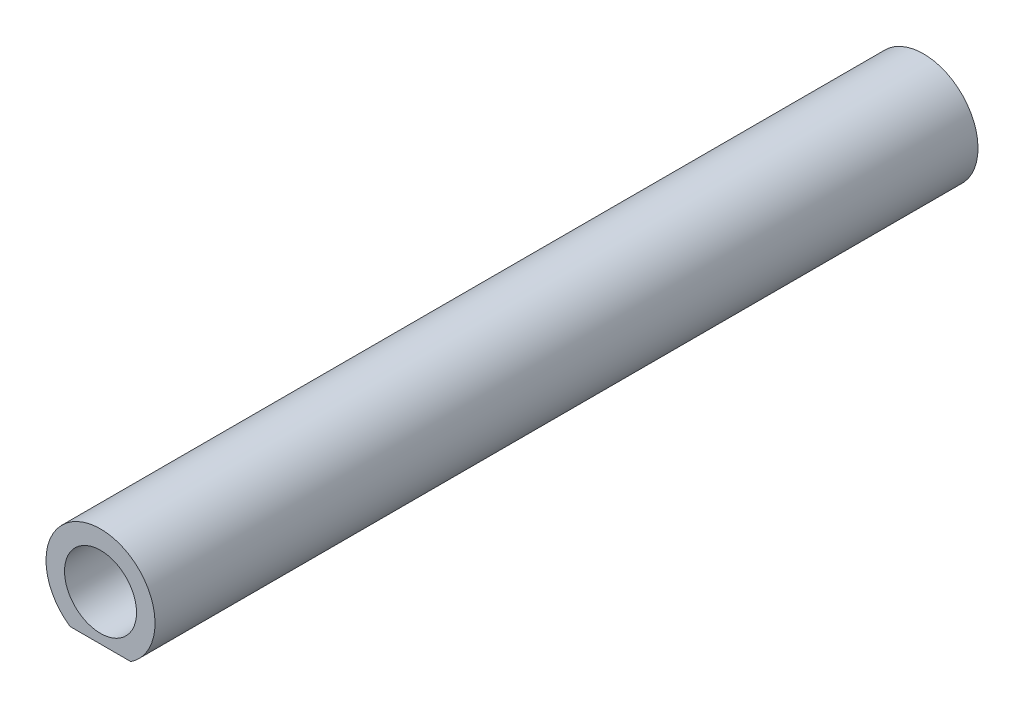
ISO-10303-21;
HEADER;
FILE_DESCRIPTION(('STEP AP214'),'2;1');
FILE_NAME('part.step','',(''),(''),'','','');
FILE_SCHEMA(('AUTOMOTIVE_DESIGN { 1 0 10303 214 1 1 1 1 }'));
ENDSEC;
DATA;
#1=APPLICATION_CONTEXT('core data for automotive mechanical design processes');
#2=APPLICATION_PROTOCOL_DEFINITION('international standard','automotive_design',2000,#1);
#3=PRODUCT_CONTEXT('',#1,'mechanical');
#4=PRODUCT('Part','Part','',(#3));
#5=PRODUCT_RELATED_PRODUCT_CATEGORY('part','',(#4));
#6=PRODUCT_DEFINITION_FORMATION('','',#4);
#7=PRODUCT_DEFINITION_CONTEXT('part definition',#1,'design');
#8=PRODUCT_DEFINITION('design','',#6,#7);
#9=PRODUCT_DEFINITION_SHAPE('','',#8);
#10=(LENGTH_UNIT() NAMED_UNIT(*) SI_UNIT(.MILLI.,.METRE.));
#11=(NAMED_UNIT(*) PLANE_ANGLE_UNIT() SI_UNIT($,.RADIAN.));
#12=(NAMED_UNIT(*) SI_UNIT($,.STERADIAN.) SOLID_ANGLE_UNIT());
#13=UNCERTAINTY_MEASURE_WITH_UNIT(LENGTH_MEASURE(1.E-05),#10,'distance_accuracy_value','');
#14=(GEOMETRIC_REPRESENTATION_CONTEXT(3) GLOBAL_UNCERTAINTY_ASSIGNED_CONTEXT((#13)) GLOBAL_UNIT_ASSIGNED_CONTEXT((#10,
#11,#12)) REPRESENTATION_CONTEXT('',''));
#15=CARTESIAN_POINT('',(0.,0.,0.));
#16=DIRECTION('',(0.,0.,1.));
#17=DIRECTION('',(1.,0.,0.));
#18=AXIS2_PLACEMENT_3D('',#15,#16,#17);
#19=CARTESIAN_POINT('',(0.,0.,254.));
#20=DIRECTION('',(0.,0.,-1.));
#21=DIRECTION('',(-1.,0.,0.));
#22=AXIS2_PLACEMENT_3D('',#19,#20,#21);
#23=CYLINDRICAL_SURFACE('',#22,16.8275);
#24=CARTESIAN_POINT('',(0.,0.,0.));
#25=DIRECTION('',(0.,0.,1.));
#26=DIRECTION('',(1.,0.,0.));
#27=AXIS2_PLACEMENT_3D('',#24,#25,#26);
#28=CIRCLE('',#27,16.8275);
#29=CARTESIAN_POINT('',(9.38103705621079,-13.97,0.));
#30=VERTEX_POINT('',#29);
#31=CARTESIAN_POINT('',(-9.38103705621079,-13.97,0.));
#32=VERTEX_POINT('',#31);
#33=EDGE_CURVE('E68',#30,#32,#28,.T.);
#34=ORIENTED_EDGE('',*,*,#33,.T.);
#35=DIRECTION('',(0.,0.,-1.));
#36=VECTOR('',#35,1.);
#37=CARTESIAN_POINT('',(-9.38103705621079,-13.97,254.));
#38=LINE('',#37,#36);
#39=CARTESIAN_POINT('',(-9.38103705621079,-13.97,254.));
#40=VERTEX_POINT('',#39);
#41=EDGE_CURVE('E11',#40,#32,#38,.T.);
#42=ORIENTED_EDGE('',*,*,#41,.F.);
#43=CARTESIAN_POINT('',(0.,0.,254.));
#44=DIRECTION('',(0.,0.,1.));
#45=DIRECTION('',(1.,0.,0.));
#46=AXIS2_PLACEMENT_3D('',#43,#44,#45);
#47=CIRCLE('',#46,16.8275);
#48=CARTESIAN_POINT('',(9.38103705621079,-13.97,254.));
#49=VERTEX_POINT('',#48);
#50=EDGE_CURVE('E71',#49,#40,#47,.T.);
#51=ORIENTED_EDGE('',*,*,#50,.F.);
#52=DIRECTION('',(0.,0.,-1.));
#53=VECTOR('',#52,1.);
#54=CARTESIAN_POINT('',(9.38103705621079,-13.97,254.));
#55=LINE('',#54,#53);
#56=EDGE_CURVE('E45',#49,#30,#55,.T.);
#57=ORIENTED_EDGE('',*,*,#56,.T.);
#58=EDGE_LOOP('',(#34,#42,#51,#57));
#59=FACE_BOUND('',#58,.T.);
#60=ADVANCED_FACE('F37',(#59),#23,.T.);
#61=CARTESIAN_POINT('',(0.,-13.97,254.));
#62=DIRECTION('',(0.,1.,0.));
#63=DIRECTION('',(0.,0.,1.));
#64=AXIS2_PLACEMENT_3D('',#61,#62,#63);
#65=PLANE('',#64);
#66=DIRECTION('',(1.,0.,0.));
#67=VECTOR('',#66,1.);
#68=CARTESIAN_POINT('',(0.,-13.97,0.));
#69=LINE('',#68,#67);
#70=EDGE_CURVE('E60',#32,#30,#69,.T.);
#71=ORIENTED_EDGE('',*,*,#70,.T.);
#72=ORIENTED_EDGE('',*,*,#56,.F.);
#73=DIRECTION('',(1.,0.,0.));
#74=VECTOR('',#73,1.);
#75=CARTESIAN_POINT('',(0.,-13.97,254.));
#76=LINE('',#75,#74);
#77=EDGE_CURVE('E52',#40,#49,#76,.T.);
#78=ORIENTED_EDGE('',*,*,#77,.F.);
#79=ORIENTED_EDGE('',*,*,#41,.T.);
#80=EDGE_LOOP('',(#71,#72,#78,#79));
#81=FACE_BOUND('',#80,.T.);
#82=ADVANCED_FACE('F63',(#81),#65,.F.);
#83=CARTESIAN_POINT('',(0.,0.,254.));
#84=DIRECTION('',(0.,0.,-1.));
#85=DIRECTION('',(-1.,0.,0.));
#86=AXIS2_PLACEMENT_3D('',#83,#84,#85);
#87=CYLINDRICAL_SURFACE('',#86,11.1125);
#88=CARTESIAN_POINT('',(0.,0.,254.));
#89=DIRECTION('',(0.,0.,1.));
#90=DIRECTION('',(1.,0.,0.));
#91=AXIS2_PLACEMENT_3D('',#88,#89,#90);
#92=CIRCLE('',#91,11.1125);
#93=CARTESIAN_POINT('',(11.1125,0.,254.));
#94=VERTEX_POINT('',#93);
#95=EDGE_CURVE('E72',#94,#94,#92,.T.);
#96=ORIENTED_EDGE('',*,*,#95,.T.);
#97=EDGE_LOOP('',(#96));
#98=FACE_BOUND('',#97,.T.);
#99=CARTESIAN_POINT('',(0.,0.,0.));
#100=DIRECTION('',(0.,0.,1.));
#101=DIRECTION('',(1.,0.,0.));
#102=AXIS2_PLACEMENT_3D('',#99,#100,#101);
#103=CIRCLE('',#102,11.1125);
#104=CARTESIAN_POINT('',(11.1125,0.,0.));
#105=VERTEX_POINT('',#104);
#106=EDGE_CURVE('E67',#105,#105,#103,.T.);
#107=ORIENTED_EDGE('',*,*,#106,.F.);
#108=EDGE_LOOP('',(#107));
#109=FACE_BOUND('',#108,.T.);
#110=ADVANCED_FACE('F85',(#98,#109),#87,.F.);
#111=CARTESIAN_POINT('',(0.,0.,254.));
#112=DIRECTION('',(0.,0.,1.));
#113=DIRECTION('',(1.,0.,0.));
#114=AXIS2_PLACEMENT_3D('',#111,#112,#113);
#115=PLANE('',#114);
#116=ORIENTED_EDGE('',*,*,#50,.T.);
#117=ORIENTED_EDGE('',*,*,#77,.T.);
#118=EDGE_LOOP('',(#116,#117));
#119=FACE_BOUND('',#118,.T.);
#120=ORIENTED_EDGE('',*,*,#95,.F.);
#121=EDGE_LOOP('',(#120));
#122=FACE_BOUND('',#121,.T.);
#123=ADVANCED_FACE('F88',(#119,#122),#115,.T.);
#124=CARTESIAN_POINT('',(0.,0.,0.));
#125=DIRECTION('',(0.,0.,1.));
#126=DIRECTION('',(1.,0.,0.));
#127=AXIS2_PLACEMENT_3D('',#124,#125,#126);
#128=PLANE('',#127);
#129=ORIENTED_EDGE('',*,*,#33,.F.);
#130=ORIENTED_EDGE('',*,*,#70,.F.);
#131=EDGE_LOOP('',(#129,#130));
#132=FACE_BOUND('',#131,.T.);
#133=ORIENTED_EDGE('',*,*,#106,.T.);
#134=EDGE_LOOP('',(#133));
#135=FACE_BOUND('',#134,.T.);
#136=ADVANCED_FACE('F73',(#132,#135),#128,.F.);
#137=CLOSED_SHELL('',(#60,#82,#110,#123,#136));
#138=MANIFOLD_SOLID_BREP('B2',#137);
#139=ADVANCED_BREP_SHAPE_REPRESENTATION('',(#18,#138),#14);
#140=SHAPE_DEFINITION_REPRESENTATION(#9,#139);
ENDSEC;
END-ISO-10303-21;
